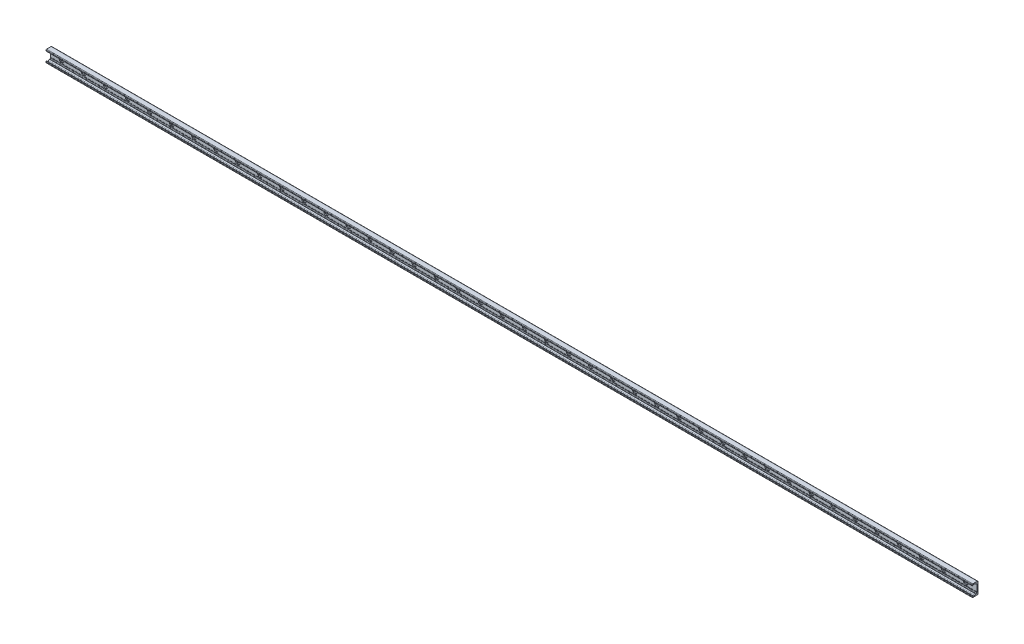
from build123d import *

# Parameters (mm, degrees)
BOSS_EXTRUDE1_DEPTH = 1680
SKETCH2_R           = 9
SKETCH2_R_2         = 4.5
CUT_EXTRUDE1_DEPTH  = 3.1
SKETCH2_2_R         = 4.5
CUT_EXTRUDE2_DEPTH  = 1681.21858697
LPATTERN1_COUNT     = 42
LPATTERN1_PITCH     = 80


with BuildPart() as part:
    # Sketch1 → Boss-Extrude1 (new, symmetric)
    with BuildSketch(Plane(origin=(0, 0, 0), x_dir=(0, 0, -1), z_dir=(1, 0, 0))):
        with BuildLine():
            Line((0, 0), (0, 19))
            ThreePointArc((0, 19), (-0.732233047, 20.767766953), (-2.5, 21.5))
            Line((-2.5, 21.5), (-19, 21.5))
            ThreePointArc((-19, 21.5), (-20.414213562, 20.914213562), (-21, 19.5))
            Line((-21, 19.5), (-21, 16.625057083))
            ThreePointArc((-21, 16.625057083), (-20.553251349, 15.888838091), (-19.693931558, 15.945160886))
            Line((-19.693931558, 15.945160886), (-16.794305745, 17.975500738))
            ThreePointArc((-16.794305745, 17.975500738), (-14.5, 18.69889256), (-12.205694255, 17.975500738))
            Line((-12.205694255, 17.975500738), (-8.829831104, 15.611695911))
            ThreePointArc((-8.829831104, 15.611695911), (-8.28408983, 15.342566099), (-7.682678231, 15.25))
            Line((-7.682678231, 15.25), (-6.5, 15.25))
            ThreePointArc((-6.5, 15.25), (-5.085786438, 14.664213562), (-4.5, 13.25))
            Line((-4.5, 13.25), (-4.5, -10.75))
            ThreePointArc((-4.5, -10.75), (-4.25, -11), (-4.5, -11.25))
            Line((-4.5, -11.25), (-4.5, -12.25))
            ThreePointArc((-4.5, -12.25), (-4.25, -12.5), (-4.5, -12.75))
            Line((-4.5, -12.75), (-4.5, -13.25))
            ThreePointArc((-4.5, -13.25), (-5.085786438, -14.664213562), (-6.5, -15.25))
            Line((-6.5, -15.25), (-7.682678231, -15.25))
            ThreePointArc((-7.682678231, -15.25), (-8.28408983, -15.342566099), (-8.829831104, -15.611695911))
            Line((-8.829831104, -15.611695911), (-12.205694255, -17.975500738))
            ThreePointArc((-12.205694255, -17.975500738), (-14.5, -18.69889256), (-16.794305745, -17.975500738))
            Line((-16.794305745, -17.975500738), (-19.693931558, -15.945160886))
            ThreePointArc((-19.693931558, -15.945160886), (-20.553251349, -15.888838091), (-21, -16.625057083))
            Line((-21, -16.625057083), (-21, -19.5))
            ThreePointArc((-21, -19.5), (-20.414213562, -20.914213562), (-19, -21.5))
            Line((-19, -21.5), (-2.5, -21.5))
            ThreePointArc((-2.5, -21.5), (-0.732233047, -20.767766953), (0, -19))
            Line((0, -19), (0, 0))
        make_face()
    extrude(amount=BOSS_EXTRUDE1_DEPTH, both=True)

    # Sketch2 → Cut-Extrude1 (cut)
    with BuildSketch(Plane.XY.offset(4.5)):
        with Locations((1640, 0)):
            Circle(SKETCH2_R)
        with Locations((1640, 0)):
            Circle(SKETCH2_R_2, mode=Mode.SUBTRACT)
    cut_extrude1 = extrude(amount=-CUT_EXTRUDE1_DEPTH, mode=Mode.SUBTRACT)

    # Sketch2_2 → Cut-Extrude2 (cut, through all)
    with BuildSketch(Plane.XY.offset(4.5)):
        with Locations((1640, 0)):
            Circle(SKETCH2_2_R)
    cut_extrude2 = extrude(amount=-CUT_EXTRUDE2_DEPTH, mode=Mode.SUBTRACT)

    # LPattern1: Cut-Extrude1, Cut-Extrude2 ×42
    with Locations(*[(-i * LPATTERN1_PITCH, 0, 0) for i in range(1, LPATTERN1_COUNT)]):
        add(cut_extrude1, mode=Mode.SUBTRACT)
        add(cut_extrude2, mode=Mode.SUBTRACT)


solid = part.part
